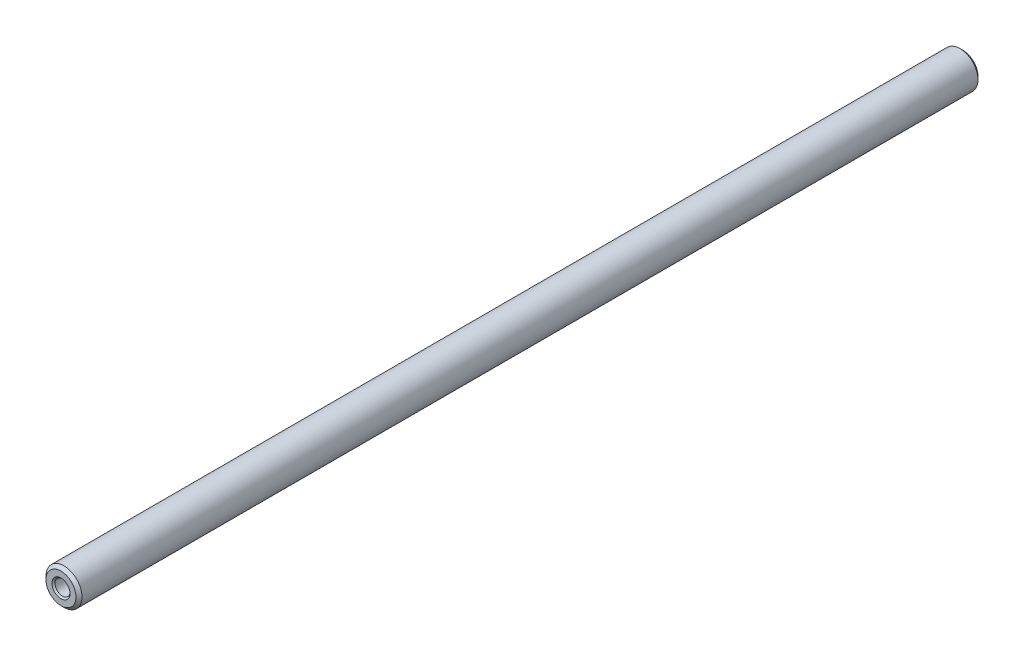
ISO-10303-21;
HEADER;
FILE_DESCRIPTION(('STEP AP214'),'2;1');
FILE_NAME('part.step','',(''),(''),'','','');
FILE_SCHEMA(('AUTOMOTIVE_DESIGN { 1 0 10303 214 1 1 1 1 }'));
ENDSEC;
DATA;
#1=APPLICATION_CONTEXT('core data for automotive mechanical design processes');
#2=APPLICATION_PROTOCOL_DEFINITION('international standard','automotive_design',2000,#1);
#3=PRODUCT_CONTEXT('',#1,'mechanical');
#4=PRODUCT('Part','Part','',(#3));
#5=PRODUCT_RELATED_PRODUCT_CATEGORY('part','',(#4));
#6=PRODUCT_DEFINITION_FORMATION('','',#4);
#7=PRODUCT_DEFINITION_CONTEXT('part definition',#1,'design');
#8=PRODUCT_DEFINITION('design','',#6,#7);
#9=PRODUCT_DEFINITION_SHAPE('','',#8);
#10=(LENGTH_UNIT() NAMED_UNIT(*) SI_UNIT(.MILLI.,.METRE.));
#11=(NAMED_UNIT(*) PLANE_ANGLE_UNIT() SI_UNIT($,.RADIAN.));
#12=(NAMED_UNIT(*) SI_UNIT($,.STERADIAN.) SOLID_ANGLE_UNIT());
#13=UNCERTAINTY_MEASURE_WITH_UNIT(LENGTH_MEASURE(1.E-05),#10,'distance_accuracy_value','');
#14=(GEOMETRIC_REPRESENTATION_CONTEXT(3) GLOBAL_UNCERTAINTY_ASSIGNED_CONTEXT((#13)) GLOBAL_UNIT_ASSIGNED_CONTEXT((#10,
#11,#12)) REPRESENTATION_CONTEXT('',''));
#15=CARTESIAN_POINT('',(0.,0.,0.));
#16=DIRECTION('',(0.,0.,1.));
#17=DIRECTION('',(1.,0.,0.));
#18=AXIS2_PLACEMENT_3D('',#15,#16,#17);
#19=CARTESIAN_POINT('',(0.,0.,150.));
#20=DIRECTION('',(0.,0.,-1.));
#21=DIRECTION('',(-1.,0.,0.));
#22=AXIS2_PLACEMENT_3D('',#19,#20,#21);
#23=CYLINDRICAL_SURFACE('',#22,2.995);
#24=CARTESIAN_POINT('',(0.,0.,0.500000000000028));
#25=DIRECTION('',(0.,0.,1.));
#26=DIRECTION('',(1.,0.,0.));
#27=AXIS2_PLACEMENT_3D('',#24,#25,#26);
#28=CIRCLE('',#27,2.995);
#29=CARTESIAN_POINT('',(2.995,0.,0.500000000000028));
#30=VERTEX_POINT('',#29);
#31=EDGE_CURVE('E81',#30,#30,#28,.T.);
#32=ORIENTED_EDGE('',*,*,#31,.T.);
#33=EDGE_LOOP('',(#32));
#34=FACE_BOUND('',#33,.T.);
#35=CARTESIAN_POINT('',(0.,0.,149.5));
#36=DIRECTION('',(0.,0.,1.));
#37=DIRECTION('',(1.,0.,0.));
#38=AXIS2_PLACEMENT_3D('',#35,#36,#37);
#39=CIRCLE('',#38,2.995);
#40=CARTESIAN_POINT('',(2.995,0.,149.5));
#41=VERTEX_POINT('',#40);
#42=EDGE_CURVE('E78',#41,#41,#39,.F.);
#43=ORIENTED_EDGE('',*,*,#42,.T.);
#44=EDGE_LOOP('',(#43));
#45=FACE_BOUND('',#44,.T.);
#46=ADVANCED_FACE('F38',(#34,#45),#23,.T.);
#47=CARTESIAN_POINT('',(0.,0.,150.));
#48=DIRECTION('',(0.,0.,1.));
#49=DIRECTION('',(1.,0.,0.));
#50=AXIS2_PLACEMENT_3D('',#47,#48,#49);
#51=PLANE('',#50);
#52=CARTESIAN_POINT('',(0.,0.,150.));
#53=DIRECTION('',(0.,0.,1.));
#54=DIRECTION('',(1.,0.,0.));
#55=AXIS2_PLACEMENT_3D('',#52,#53,#54);
#56=CIRCLE('',#55,2.49500000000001);
#57=CARTESIAN_POINT('',(2.49500000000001,0.,150.));
#58=VERTEX_POINT('',#57);
#59=EDGE_CURVE('E11',#58,#58,#56,.T.);
#60=ORIENTED_EDGE('',*,*,#59,.T.);
#61=EDGE_LOOP('',(#60));
#62=FACE_BOUND('',#61,.T.);
#63=CARTESIAN_POINT('',(0.,0.,150.));
#64=DIRECTION('',(0.,0.,1.));
#65=DIRECTION('',(1.,0.,0.));
#66=AXIS2_PLACEMENT_3D('',#63,#64,#65);
#67=CIRCLE('',#66,1.5);
#68=CARTESIAN_POINT('',(1.5,0.,150.));
#69=VERTEX_POINT('',#68);
#70=EDGE_CURVE('E62',#69,#69,#67,.T.);
#71=ORIENTED_EDGE('',*,*,#70,.F.);
#72=EDGE_LOOP('',(#71));
#73=FACE_BOUND('',#72,.T.);
#74=ADVANCED_FACE('F97',(#62,#73),#51,.T.);
#75=CARTESIAN_POINT('',(0.,0.,0.));
#76=DIRECTION('',(0.,0.,1.));
#77=DIRECTION('',(1.,0.,0.));
#78=AXIS2_PLACEMENT_3D('',#75,#76,#77);
#79=PLANE('',#78);
#80=CARTESIAN_POINT('',(0.,0.,0.));
#81=DIRECTION('',(0.,0.,1.));
#82=DIRECTION('',(1.,0.,0.));
#83=AXIS2_PLACEMENT_3D('',#80,#81,#82);
#84=CIRCLE('',#83,2.49499999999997);
#85=CARTESIAN_POINT('',(2.49499999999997,0.,0.));
#86=VERTEX_POINT('',#85);
#87=EDGE_CURVE('E46',#86,#86,#84,.F.);
#88=ORIENTED_EDGE('',*,*,#87,.T.);
#89=EDGE_LOOP('',(#88));
#90=FACE_BOUND('',#89,.T.);
#91=CARTESIAN_POINT('',(0.,0.,0.));
#92=DIRECTION('',(0.,0.,-1.));
#93=DIRECTION('',(-1.,0.,0.));
#94=AXIS2_PLACEMENT_3D('',#91,#92,#93);
#95=CIRCLE('',#94,1.5);
#96=CARTESIAN_POINT('',(-1.5,0.,0.));
#97=VERTEX_POINT('',#96);
#98=EDGE_CURVE('E69',#97,#97,#95,.T.);
#99=ORIENTED_EDGE('',*,*,#98,.F.);
#100=EDGE_LOOP('',(#99));
#101=FACE_BOUND('',#100,.T.);
#102=ADVANCED_FACE('F86',(#90,#101),#79,.F.);
#103=CARTESIAN_POINT('',(0.,0.,147.));
#104=DIRECTION('',(0.,0.,1.));
#105=DIRECTION('',(1.,0.,0.));
#106=AXIS2_PLACEMENT_3D('',#103,#104,#105);
#107=CONICAL_SURFACE('',#106,1.25,1.02974425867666);
#108=CARTESIAN_POINT('',(0.,0.,146.248924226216));
#109=VERTEX_POINT('',#108);
#110=VERTEX_LOOP('',#109);
#111=FACE_BOUND('',#110,.T.);
#112=CARTESIAN_POINT('',(0.,0.,147.));
#113=DIRECTION('',(0.,0.,1.));
#114=DIRECTION('',(1.,0.,0.));
#115=AXIS2_PLACEMENT_3D('',#112,#113,#114);
#116=CIRCLE('',#115,1.25);
#117=CARTESIAN_POINT('',(1.25,0.,147.));
#118=VERTEX_POINT('',#117);
#119=EDGE_CURVE('E75',#118,#118,#116,.T.);
#120=ORIENTED_EDGE('',*,*,#119,.T.);
#121=EDGE_LOOP('',(#120));
#122=FACE_BOUND('',#121,.T.);
#123=ADVANCED_FACE('F117',(#111,#122),#107,.F.);
#124=CARTESIAN_POINT('',(0.,0.,150.));
#125=DIRECTION('',(0.,0.,1.));
#126=DIRECTION('',(1.,0.,0.));
#127=AXIS2_PLACEMENT_3D('',#124,#125,#126);
#128=CYLINDRICAL_SURFACE('',#127,1.25);
#129=ORIENTED_EDGE('',*,*,#119,.F.);
#130=EDGE_LOOP('',(#129));
#131=FACE_BOUND('',#130,.T.);
#132=CARTESIAN_POINT('',(0.,0.,149.75));
#133=DIRECTION('',(0.,0.,1.));
#134=DIRECTION('',(1.,0.,0.));
#135=AXIS2_PLACEMENT_3D('',#132,#133,#134);
#136=CIRCLE('',#135,1.25);
#137=CARTESIAN_POINT('',(1.25,0.,149.75));
#138=VERTEX_POINT('',#137);
#139=EDGE_CURVE('E66',#138,#138,#136,.T.);
#140=ORIENTED_EDGE('',*,*,#139,.T.);
#141=EDGE_LOOP('',(#140));
#142=FACE_BOUND('',#141,.T.);
#143=ADVANCED_FACE('F111',(#131,#142),#128,.F.);
#144=CARTESIAN_POINT('',(0.,0.,150.));
#145=DIRECTION('',(0.,0.,1.));
#146=DIRECTION('',(1.,0.,0.));
#147=AXIS2_PLACEMENT_3D('',#144,#145,#146);
#148=CONICAL_SURFACE('',#147,1.5,0.785398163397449);
#149=ORIENTED_EDGE('',*,*,#139,.F.);
#150=EDGE_LOOP('',(#149));
#151=FACE_BOUND('',#150,.T.);
#152=ORIENTED_EDGE('',*,*,#70,.T.);
#153=EDGE_LOOP('',(#152));
#154=FACE_BOUND('',#153,.T.);
#155=ADVANCED_FACE('F56',(#151,#154),#148,.F.);
#156=CARTESIAN_POINT('',(0.,0.,3.));
#157=DIRECTION('',(0.,0.,-1.));
#158=DIRECTION('',(-1.,0.,0.));
#159=AXIS2_PLACEMENT_3D('',#156,#157,#158);
#160=CONICAL_SURFACE('',#159,1.25,1.02974425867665);
#161=CARTESIAN_POINT('',(0.,0.,3.75107577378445));
#162=VERTEX_POINT('',#161);
#163=VERTEX_LOOP('',#162);
#164=FACE_BOUND('',#163,.T.);
#165=CARTESIAN_POINT('',(0.,0.,3.));
#166=DIRECTION('',(0.,0.,-1.));
#167=DIRECTION('',(-1.,0.,0.));
#168=AXIS2_PLACEMENT_3D('',#165,#166,#167);
#169=CIRCLE('',#168,1.25);
#170=CARTESIAN_POINT('',(-1.25,0.,3.));
#171=VERTEX_POINT('',#170);
#172=EDGE_CURVE('E60',#171,#171,#169,.T.);
#173=ORIENTED_EDGE('',*,*,#172,.T.);
#174=EDGE_LOOP('',(#173));
#175=FACE_BOUND('',#174,.T.);
#176=ADVANCED_FACE('F52',(#164,#175),#160,.F.);
#177=CARTESIAN_POINT('',(0.,0.,0.));
#178=DIRECTION('',(0.,0.,-1.));
#179=DIRECTION('',(-1.,0.,0.));
#180=AXIS2_PLACEMENT_3D('',#177,#178,#179);
#181=CYLINDRICAL_SURFACE('',#180,1.24999999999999);
#182=ORIENTED_EDGE('',*,*,#172,.F.);
#183=EDGE_LOOP('',(#182));
#184=FACE_BOUND('',#183,.T.);
#185=CARTESIAN_POINT('',(0.,0.,0.25));
#186=DIRECTION('',(0.,0.,-1.));
#187=DIRECTION('',(-1.,0.,0.));
#188=AXIS2_PLACEMENT_3D('',#185,#186,#187);
#189=CIRCLE('',#188,1.24999999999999);
#190=CARTESIAN_POINT('',(-1.24999999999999,0.,0.25));
#191=VERTEX_POINT('',#190);
#192=EDGE_CURVE('E63',#191,#191,#189,.T.);
#193=ORIENTED_EDGE('',*,*,#192,.T.);
#194=EDGE_LOOP('',(#193));
#195=FACE_BOUND('',#194,.T.);
#196=ADVANCED_FACE('F55',(#184,#195),#181,.F.);
#197=CARTESIAN_POINT('',(0.,0.,0.));
#198=DIRECTION('',(0.,0.,-1.));
#199=DIRECTION('',(-1.,0.,0.));
#200=AXIS2_PLACEMENT_3D('',#197,#198,#199);
#201=CONICAL_SURFACE('',#200,1.5,0.785398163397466);
#202=ORIENTED_EDGE('',*,*,#192,.F.);
#203=EDGE_LOOP('',(#202));
#204=FACE_BOUND('',#203,.T.);
#205=ORIENTED_EDGE('',*,*,#98,.T.);
#206=EDGE_LOOP('',(#205));
#207=FACE_BOUND('',#206,.T.);
#208=ADVANCED_FACE('F92',(#204,#207),#201,.F.);
#209=CARTESIAN_POINT('',(0.,0.,0.500000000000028));
#210=DIRECTION('',(0.,0.,1.));
#211=DIRECTION('',(1.,0.,0.));
#212=AXIS2_PLACEMENT_3D('',#209,#210,#211);
#213=CONICAL_SURFACE('',#212,2.995,0.785398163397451);
#214=ORIENTED_EDGE('',*,*,#87,.F.);
#215=EDGE_LOOP('',(#214));
#216=FACE_BOUND('',#215,.T.);
#217=ORIENTED_EDGE('',*,*,#31,.F.);
#218=EDGE_LOOP('',(#217));
#219=FACE_BOUND('',#218,.T.);
#220=ADVANCED_FACE('F89',(#216,#219),#213,.T.);
#221=CARTESIAN_POINT('',(0.,0.,150.));
#222=DIRECTION('',(0.,0.,-1.));
#223=DIRECTION('',(-1.,0.,0.));
#224=AXIS2_PLACEMENT_3D('',#221,#222,#223);
#225=CONICAL_SURFACE('',#224,2.49500000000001,0.785398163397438);
#226=ORIENTED_EDGE('',*,*,#42,.F.);
#227=EDGE_LOOP('',(#226));
#228=FACE_BOUND('',#227,.T.);
#229=ORIENTED_EDGE('',*,*,#59,.F.);
#230=EDGE_LOOP('',(#229));
#231=FACE_BOUND('',#230,.T.);
#232=ADVANCED_FACE('F40',(#228,#231),#225,.T.);
#233=CLOSED_SHELL('',(#46,#74,#102,#123,#143,#155,#176,#196,#208,#220,#232));
#234=MANIFOLD_SOLID_BREP('B2',#233);
#235=ADVANCED_BREP_SHAPE_REPRESENTATION('',(#18,#234),#14);
#236=SHAPE_DEFINITION_REPRESENTATION(#9,#235);
ENDSEC;
END-ISO-10303-21;
